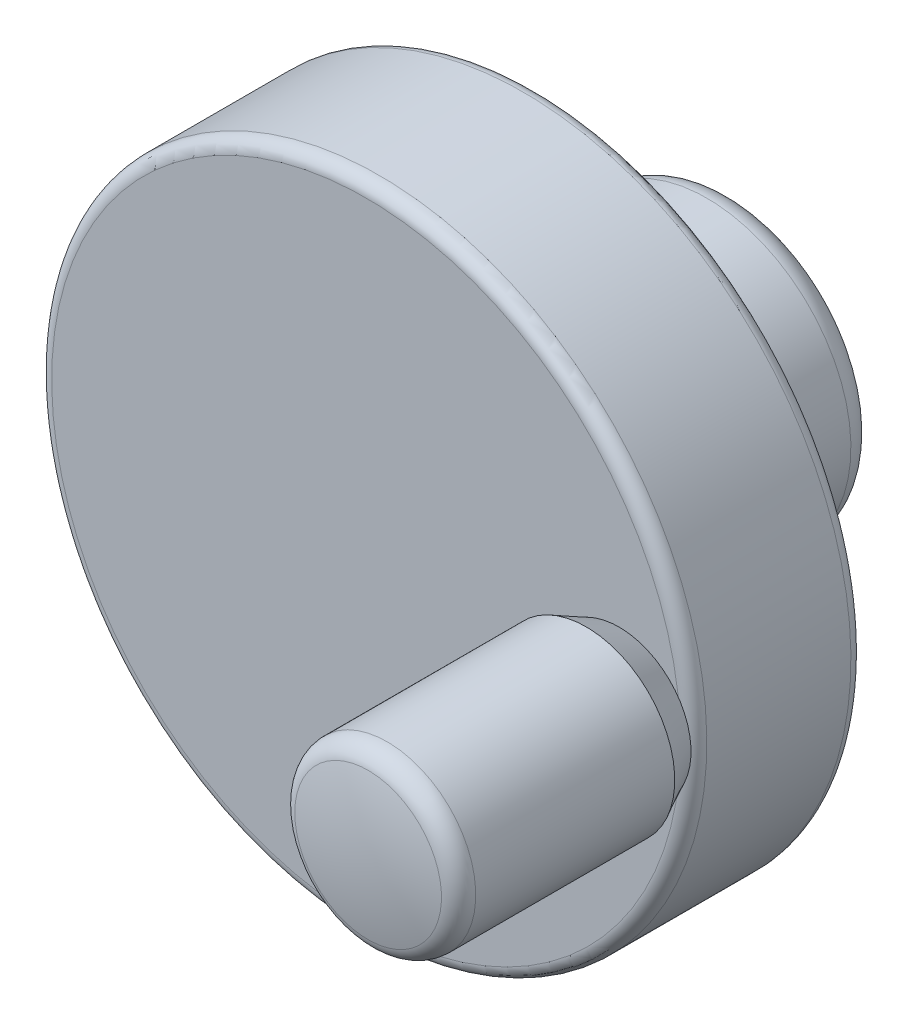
ISO-10303-21;
HEADER;
FILE_DESCRIPTION(('STEP AP214'),'2;1');
FILE_NAME('part.step','',(''),(''),'','','');
FILE_SCHEMA(('AUTOMOTIVE_DESIGN { 1 0 10303 214 1 1 1 1 }'));
ENDSEC;
DATA;
#1=APPLICATION_CONTEXT('core data for automotive mechanical design processes');
#2=APPLICATION_PROTOCOL_DEFINITION('international standard','automotive_design',2000,#1);
#3=PRODUCT_CONTEXT('',#1,'mechanical');
#4=PRODUCT('Part','Part','',(#3));
#5=PRODUCT_RELATED_PRODUCT_CATEGORY('part','',(#4));
#6=PRODUCT_DEFINITION_FORMATION('','',#4);
#7=PRODUCT_DEFINITION_CONTEXT('part definition',#1,'design');
#8=PRODUCT_DEFINITION('design','',#6,#7);
#9=PRODUCT_DEFINITION_SHAPE('','',#8);
#10=(LENGTH_UNIT() NAMED_UNIT(*) SI_UNIT(.MILLI.,.METRE.));
#11=(NAMED_UNIT(*) PLANE_ANGLE_UNIT() SI_UNIT($,.RADIAN.));
#12=(NAMED_UNIT(*) SI_UNIT($,.STERADIAN.) SOLID_ANGLE_UNIT());
#13=UNCERTAINTY_MEASURE_WITH_UNIT(LENGTH_MEASURE(1.E-05),#10,'distance_accuracy_value','');
#14=(GEOMETRIC_REPRESENTATION_CONTEXT(3) GLOBAL_UNCERTAINTY_ASSIGNED_CONTEXT((#13)) GLOBAL_UNIT_ASSIGNED_CONTEXT((#10,
#11,#12)) REPRESENTATION_CONTEXT('',''));
#15=CARTESIAN_POINT('',(0.,0.,0.));
#16=DIRECTION('',(0.,0.,1.));
#17=DIRECTION('',(1.,0.,0.));
#18=AXIS2_PLACEMENT_3D('',#15,#16,#17);
#19=CARTESIAN_POINT('',(0.,0.,33.));
#20=DIRECTION('',(0.,0.,1.));
#21=DIRECTION('',(0.,-1.,0.));
#22=AXIS2_PLACEMENT_3D('',#19,#20,#21);
#23=CYLINDRICAL_SURFACE('',#22,2.5);
#24=CARTESIAN_POINT('',(0.,0.,0.));
#25=DIRECTION('',(0.,0.,1.));
#26=DIRECTION('',(0.,-1.,0.));
#27=AXIS2_PLACEMENT_3D('',#24,#25,#26);
#28=CIRCLE('',#27,2.5);
#29=CARTESIAN_POINT('',(0.,-2.5,0.));
#30=VERTEX_POINT('',#29);
#31=EDGE_CURVE('E46',#30,#30,#28,.T.);
#32=ORIENTED_EDGE('',*,*,#31,.F.);
#33=EDGE_LOOP('',(#32));
#34=FACE_BOUND('',#33,.T.);
#35=CARTESIAN_POINT('',(0.,0.,15.));
#36=DIRECTION('',(0.,0.,-1.));
#37=DIRECTION('',(0.,1.,0.));
#38=AXIS2_PLACEMENT_3D('',#35,#36,#37);
#39=CIRCLE('',#38,2.5);
#40=CARTESIAN_POINT('',(0.,2.5,15.));
#41=VERTEX_POINT('',#40);
#42=EDGE_CURVE('E64',#41,#41,#39,.T.);
#43=ORIENTED_EDGE('',*,*,#42,.F.);
#44=EDGE_LOOP('',(#43));
#45=FACE_BOUND('',#44,.T.);
#46=ADVANCED_FACE('F12',(#34,#45),#23,.F.);
#47=CARTESIAN_POINT('',(0.,0.,28.));
#48=DIRECTION('',(0.,0.,1.));
#49=DIRECTION('',(0.,-1.,0.));
#50=AXIS2_PLACEMENT_3D('',#47,#48,#49);
#51=PLANE('',#50);
#52=CARTESIAN_POINT('',(19.5,0.,28.));
#53=DIRECTION('',(0.,0.,1.));
#54=DIRECTION('',(0.,-1.,0.));
#55=AXIS2_PLACEMENT_3D('',#52,#53,#54);
#56=CIRCLE('',#55,3.99999999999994);
#57=CARTESIAN_POINT('',(19.5,-3.99999999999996,28.));
#58=VERTEX_POINT('',#57);
#59=EDGE_CURVE('E8',#58,#58,#56,.T.);
#60=ORIENTED_EDGE('',*,*,#59,.F.);
#61=EDGE_LOOP('',(#60));
#62=FACE_BOUND('',#61,.T.);
#63=CARTESIAN_POINT('',(0.,0.,28.));
#64=DIRECTION('',(0.,0.,1.));
#65=DIRECTION('',(0.,-1.,0.));
#66=AXIS2_PLACEMENT_3D('',#63,#64,#65);
#67=CIRCLE('',#66,24.);
#68=CARTESIAN_POINT('',(0.,-24.,28.));
#69=VERTEX_POINT('',#68);
#70=EDGE_CURVE('E18',#69,#69,#67,.T.);
#71=ORIENTED_EDGE('',*,*,#70,.T.);
#72=EDGE_LOOP('',(#71));
#73=FACE_BOUND('',#72,.T.);
#74=ADVANCED_FACE('F71',(#62,#73),#51,.T.);
#75=CARTESIAN_POINT('',(0.,0.,27.));
#76=DIRECTION('',(0.,0.,1.));
#77=DIRECTION('',(0.,-1.,0.));
#78=AXIS2_PLACEMENT_3D('',#75,#76,#77);
#79=TOROIDAL_SURFACE('',#78,24.,1.);
#80=CARTESIAN_POINT('',(0.,0.,27.));
#81=DIRECTION('',(0.,0.,1.));
#82=DIRECTION('',(0.,-1.,0.));
#83=AXIS2_PLACEMENT_3D('',#80,#81,#82);
#84=CIRCLE('',#83,25.);
#85=CARTESIAN_POINT('',(0.,-25.,27.));
#86=VERTEX_POINT('',#85);
#87=EDGE_CURVE('E22',#86,#86,#84,.T.);
#88=ORIENTED_EDGE('',*,*,#87,.T.);
#89=EDGE_LOOP('',(#88));
#90=FACE_BOUND('',#89,.T.);
#91=ORIENTED_EDGE('',*,*,#70,.F.);
#92=EDGE_LOOP('',(#91));
#93=FACE_BOUND('',#92,.T.);
#94=ADVANCED_FACE('F77',(#90,#93),#79,.T.);
#95=CARTESIAN_POINT('',(0.,0.,33.));
#96=DIRECTION('',(0.,0.,1.));
#97=DIRECTION('',(0.,-1.,0.));
#98=AXIS2_PLACEMENT_3D('',#95,#96,#97);
#99=CYLINDRICAL_SURFACE('',#98,25.);
#100=CARTESIAN_POINT('',(0.,0.,16.));
#101=DIRECTION('',(0.,0.,1.));
#102=DIRECTION('',(0.,-1.,0.));
#103=AXIS2_PLACEMENT_3D('',#100,#101,#102);
#104=CIRCLE('',#103,25.);
#105=CARTESIAN_POINT('',(0.,-25.,16.));
#106=VERTEX_POINT('',#105);
#107=EDGE_CURVE('E26',#106,#106,#104,.T.);
#108=ORIENTED_EDGE('',*,*,#107,.T.);
#109=EDGE_LOOP('',(#108));
#110=FACE_BOUND('',#109,.T.);
#111=ORIENTED_EDGE('',*,*,#87,.F.);
#112=EDGE_LOOP('',(#111));
#113=FACE_BOUND('',#112,.T.);
#114=ADVANCED_FACE('F114',(#110,#113),#99,.T.);
#115=CARTESIAN_POINT('',(0.,0.,16.));
#116=DIRECTION('',(0.,0.,1.));
#117=DIRECTION('',(0.,-1.,0.));
#118=AXIS2_PLACEMENT_3D('',#115,#116,#117);
#119=TOROIDAL_SURFACE('',#118,24.,1.);
#120=CARTESIAN_POINT('',(0.,0.,15.));
#121=DIRECTION('',(0.,0.,1.));
#122=DIRECTION('',(0.,-1.,0.));
#123=AXIS2_PLACEMENT_3D('',#120,#121,#122);
#124=CIRCLE('',#123,24.);
#125=CARTESIAN_POINT('',(0.,-24.,15.));
#126=VERTEX_POINT('',#125);
#127=EDGE_CURVE('E31',#126,#126,#124,.T.);
#128=ORIENTED_EDGE('',*,*,#127,.T.);
#129=EDGE_LOOP('',(#128));
#130=FACE_BOUND('',#129,.T.);
#131=ORIENTED_EDGE('',*,*,#107,.F.);
#132=EDGE_LOOP('',(#131));
#133=FACE_BOUND('',#132,.T.);
#134=ADVANCED_FACE('F110',(#130,#133),#119,.T.);
#135=CARTESIAN_POINT('',(-14.,0.,15.));
#136=DIRECTION('',(0.,0.,1.));
#137=DIRECTION('',(0.,-1.,0.));
#138=AXIS2_PLACEMENT_3D('',#135,#136,#137);
#139=PLANE('',#138);
#140=ORIENTED_EDGE('',*,*,#127,.F.);
#141=EDGE_LOOP('',(#140));
#142=FACE_BOUND('',#141,.T.);
#143=CARTESIAN_POINT('',(0.,0.,15.));
#144=DIRECTION('',(0.,0.,1.));
#145=DIRECTION('',(0.,-1.,0.));
#146=AXIS2_PLACEMENT_3D('',#143,#144,#145);
#147=CIRCLE('',#146,14.);
#148=CARTESIAN_POINT('',(0.,-14.,15.));
#149=VERTEX_POINT('',#148);
#150=EDGE_CURVE('E34',#149,#149,#147,.T.);
#151=ORIENTED_EDGE('',*,*,#150,.T.);
#152=EDGE_LOOP('',(#151));
#153=FACE_BOUND('',#152,.T.);
#154=ADVANCED_FACE('F106',(#142,#153),#139,.F.);
#155=CARTESIAN_POINT('',(0.,0.,12.));
#156=DIRECTION('',(0.,0.,1.));
#157=DIRECTION('',(0.,-1.,0.));
#158=AXIS2_PLACEMENT_3D('',#155,#156,#157);
#159=TOROIDAL_SURFACE('',#158,14.,3.);
#160=ORIENTED_EDGE('',*,*,#150,.F.);
#161=EDGE_LOOP('',(#160));
#162=FACE_BOUND('',#161,.T.);
#163=CARTESIAN_POINT('',(0.,0.,12.));
#164=DIRECTION('',(0.,0.,1.));
#165=DIRECTION('',(0.,-1.,0.));
#166=AXIS2_PLACEMENT_3D('',#163,#164,#165);
#167=CIRCLE('',#166,11.);
#168=CARTESIAN_POINT('',(0.,-11.,12.));
#169=VERTEX_POINT('',#168);
#170=EDGE_CURVE('E37',#169,#169,#167,.T.);
#171=ORIENTED_EDGE('',*,*,#170,.T.);
#172=EDGE_LOOP('',(#171));
#173=FACE_BOUND('',#172,.T.);
#174=ADVANCED_FACE('F102',(#162,#173),#159,.F.);
#175=CARTESIAN_POINT('',(0.,0.,33.));
#176=DIRECTION('',(0.,0.,1.));
#177=DIRECTION('',(0.,-1.,0.));
#178=AXIS2_PLACEMENT_3D('',#175,#176,#177);
#179=CYLINDRICAL_SURFACE('',#178,11.);
#180=CARTESIAN_POINT('',(0.,0.,2.));
#181=DIRECTION('',(0.,0.,1.));
#182=DIRECTION('',(0.,-1.,0.));
#183=AXIS2_PLACEMENT_3D('',#180,#181,#182);
#184=CIRCLE('',#183,11.);
#185=CARTESIAN_POINT('',(0.,-11.,2.));
#186=VERTEX_POINT('',#185);
#187=EDGE_CURVE('E40',#186,#186,#184,.T.);
#188=ORIENTED_EDGE('',*,*,#187,.T.);
#189=EDGE_LOOP('',(#188));
#190=FACE_BOUND('',#189,.T.);
#191=ORIENTED_EDGE('',*,*,#170,.F.);
#192=EDGE_LOOP('',(#191));
#193=FACE_BOUND('',#192,.T.);
#194=ADVANCED_FACE('F94',(#190,#193),#179,.T.);
#195=CARTESIAN_POINT('',(0.,0.,2.));
#196=DIRECTION('',(0.,0.,1.));
#197=DIRECTION('',(0.,-1.,0.));
#198=AXIS2_PLACEMENT_3D('',#195,#196,#197);
#199=TOROIDAL_SURFACE('',#198,9.,2.);
#200=CARTESIAN_POINT('',(0.,0.,0.));
#201=DIRECTION('',(0.,0.,1.));
#202=DIRECTION('',(0.,-1.,0.));
#203=AXIS2_PLACEMENT_3D('',#200,#201,#202);
#204=CIRCLE('',#203,9.);
#205=CARTESIAN_POINT('',(0.,-9.,0.));
#206=VERTEX_POINT('',#205);
#207=EDGE_CURVE('E43',#206,#206,#204,.T.);
#208=ORIENTED_EDGE('',*,*,#207,.T.);
#209=EDGE_LOOP('',(#208));
#210=FACE_BOUND('',#209,.T.);
#211=ORIENTED_EDGE('',*,*,#187,.F.);
#212=EDGE_LOOP('',(#211));
#213=FACE_BOUND('',#212,.T.);
#214=ADVANCED_FACE('F84',(#210,#213),#199,.T.);
#215=CARTESIAN_POINT('',(-2.5,0.,0.));
#216=DIRECTION('',(0.,0.,1.));
#217=DIRECTION('',(0.,-1.,0.));
#218=AXIS2_PLACEMENT_3D('',#215,#216,#217);
#219=PLANE('',#218);
#220=ORIENTED_EDGE('',*,*,#207,.F.);
#221=EDGE_LOOP('',(#220));
#222=FACE_BOUND('',#221,.T.);
#223=ORIENTED_EDGE('',*,*,#31,.T.);
#224=EDGE_LOOP('',(#223));
#225=FACE_BOUND('',#224,.T.);
#226=ADVANCED_FACE('F81',(#222,#225),#219,.F.);
#227=CARTESIAN_POINT('',(19.5,0.,23.6000000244));
#228=DIRECTION('',(0.,1.,0.));
#229=DIRECTION('',(0.,0.,1.));
#230=AXIS2_PLACEMENT_3D('',#227,#228,#229);
#231=SPHERICAL_SURFACE('',#230,24.3999999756);
#232=CARTESIAN_POINT('',(19.5,0.,23.6000000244));
#233=DIRECTION('',(0.,0.,-1.));
#234=DIRECTION('',(-1.,0.,0.));
#235=AXIS2_PLACEMENT_3D('',#232,#233,#234);
#236=SPHERICAL_SURFACE('',#235,24.3999999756);
#237=CARTESIAN_POINT('',(19.5,0.,47.3491215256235));
#238=DIRECTION('',(0.,0.,-1.));
#239=DIRECTION('',(-1.,0.,0.));
#240=AXIS2_PLACEMENT_3D('',#237,#238,#239);
#241=CIRCLE('',#240,5.59814493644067);
#242=CARTESIAN_POINT('',(13.9018550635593,0.,47.3491215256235));
#243=VERTEX_POINT('',#242);
#244=EDGE_CURVE('E49',#243,#243,#241,.T.);
#245=ORIENTED_EDGE('',*,*,#244,.F.);
#246=EDGE_LOOP('',(#245));
#247=FACE_BOUND('',#246,.T.);
#248=ADVANCED_FACE('F83',(#247),#236,.T.);
#249=CARTESIAN_POINT('',(19.5,0.,45.8891345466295));
#250=DIRECTION('',(0.,0.,-1.));
#251=DIRECTION('',(-1.,0.,0.));
#252=AXIS2_PLACEMENT_3D('',#249,#250,#251);
#253=TOROIDAL_SURFACE('',#252,5.25399668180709,1.50000000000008);
#254=CARTESIAN_POINT('',(19.5,0.,45.8891345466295));
#255=DIRECTION('',(0.,0.,-1.));
#256=DIRECTION('',(-1.,0.,0.));
#257=AXIS2_PLACEMENT_3D('',#254,#255,#256);
#258=CIRCLE('',#257,6.75399668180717);
#259=CARTESIAN_POINT('',(12.7460033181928,0.,45.8891345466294));
#260=VERTEX_POINT('',#259);
#261=EDGE_CURVE('E52',#260,#260,#258,.T.);
#262=ORIENTED_EDGE('',*,*,#261,.F.);
#263=EDGE_LOOP('',(#262));
#264=FACE_BOUND('',#263,.T.);
#265=ORIENTED_EDGE('',*,*,#244,.T.);
#266=EDGE_LOOP('',(#265));
#267=FACE_BOUND('',#266,.T.);
#268=ADVANCED_FACE('F91',(#264,#267),#253,.T.);
#269=CARTESIAN_POINT('',(19.5,0.,16.965494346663));
#270=DIRECTION('',(0.,0.,-1.));
#271=DIRECTION('',(-1.,0.,0.));
#272=AXIS2_PLACEMENT_3D('',#269,#270,#271);
#273=CYLINDRICAL_SURFACE('',#272,6.75399668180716);
#274=CARTESIAN_POINT('',(19.5,0.,30.700000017));
#275=DIRECTION('',(0.,0.,-1.));
#276=DIRECTION('',(-1.,0.,0.));
#277=AXIS2_PLACEMENT_3D('',#274,#275,#276);
#278=CIRCLE('',#277,6.75399668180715);
#279=CARTESIAN_POINT('',(12.7460033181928,0.,30.700000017));
#280=VERTEX_POINT('',#279);
#281=EDGE_CURVE('E55',#280,#280,#278,.T.);
#282=ORIENTED_EDGE('',*,*,#281,.F.);
#283=EDGE_LOOP('',(#282));
#284=FACE_BOUND('',#283,.T.);
#285=ORIENTED_EDGE('',*,*,#261,.T.);
#286=EDGE_LOOP('',(#285));
#287=FACE_BOUND('',#286,.T.);
#288=ADVANCED_FACE('F176',(#284,#287),#273,.T.);
#289=CARTESIAN_POINT('',(19.5,0.,28.2));
#290=DIRECTION('',(0.,0.,1.));
#291=DIRECTION('',(1.,0.,0.));
#292=AXIS2_PLACEMENT_3D('',#289,#290,#291);
#293=CONICAL_SURFACE('',#292,5.49515095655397,0.466474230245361);
#294=ORIENTED_EDGE('',*,*,#281,.T.);
#295=EDGE_LOOP('',(#294));
#296=FACE_BOUND('',#295,.T.);
#297=CARTESIAN_POINT('',(19.5,0.,28.2));
#298=DIRECTION('',(0.,0.,-1.));
#299=DIRECTION('',(-1.,0.,0.));
#300=AXIS2_PLACEMENT_3D('',#297,#298,#299);
#301=CIRCLE('',#300,5.49515095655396);
#302=CARTESIAN_POINT('',(14.004849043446,0.,28.2));
#303=VERTEX_POINT('',#302);
#304=EDGE_CURVE('E58',#303,#303,#301,.T.);
#305=ORIENTED_EDGE('',*,*,#304,.F.);
#306=EDGE_LOOP('',(#305));
#307=FACE_BOUND('',#306,.T.);
#308=ADVANCED_FACE('F185',(#296,#307),#293,.T.);
#309=CARTESIAN_POINT('',(24.9951509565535,0.,28.2));
#310=DIRECTION('',(0.,0.,1.));
#311=DIRECTION('',(1.,0.,0.));
#312=AXIS2_PLACEMENT_3D('',#309,#310,#311);
#313=PLANE('',#312);
#314=CARTESIAN_POINT('',(19.5,0.,28.2));
#315=DIRECTION('',(0.,0.,-1.));
#316=DIRECTION('',(-1.,0.,0.));
#317=AXIS2_PLACEMENT_3D('',#314,#315,#316);
#318=CIRCLE('',#317,3.99999999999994);
#319=CARTESIAN_POINT('',(15.5000000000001,0.,28.2));
#320=VERTEX_POINT('',#319);
#321=EDGE_CURVE('E61',#320,#320,#318,.T.);
#322=ORIENTED_EDGE('',*,*,#321,.F.);
#323=EDGE_LOOP('',(#322));
#324=FACE_BOUND('',#323,.T.);
#325=ORIENTED_EDGE('',*,*,#304,.T.);
#326=EDGE_LOOP('',(#325));
#327=FACE_BOUND('',#326,.T.);
#328=ADVANCED_FACE('F195',(#324,#327),#313,.F.);
#329=CARTESIAN_POINT('',(19.5,0.,16.965494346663));
#330=DIRECTION('',(0.,0.,-1.));
#331=DIRECTION('',(-1.,0.,0.));
#332=AXIS2_PLACEMENT_3D('',#329,#330,#331);
#333=CYLINDRICAL_SURFACE('',#332,3.99999999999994);
#334=ORIENTED_EDGE('',*,*,#321,.T.);
#335=EDGE_LOOP('',(#334));
#336=FACE_BOUND('',#335,.T.);
#337=ORIENTED_EDGE('',*,*,#59,.T.);
#338=EDGE_LOOP('',(#337));
#339=FACE_BOUND('',#338,.T.);
#340=ADVANCED_FACE('F205',(#336,#339),#333,.T.);
#341=CARTESIAN_POINT('',(0.,0.,15.));
#342=DIRECTION('',(0.,0.,-1.));
#343=DIRECTION('',(0.,1.,0.));
#344=AXIS2_PLACEMENT_3D('',#341,#342,#343);
#345=PLANE('',#344);
#346=ORIENTED_EDGE('',*,*,#42,.T.);
#347=EDGE_LOOP('',(#346));
#348=FACE_BOUND('',#347,.T.);
#349=ADVANCED_FACE('F68',(#348),#345,.T.);
#350=CLOSED_SHELL('',(#46,#74,#94,#114,#134,#154,#174,#194,#214,#226,#248,#268,#288,#308,#328,
#340,#349));
#351=MANIFOLD_SOLID_BREP('B1',#350);
#352=ADVANCED_BREP_SHAPE_REPRESENTATION('',(#18,#351),#14);
#353=SHAPE_DEFINITION_REPRESENTATION(#9,#352);
ENDSEC;
END-ISO-10303-21;
